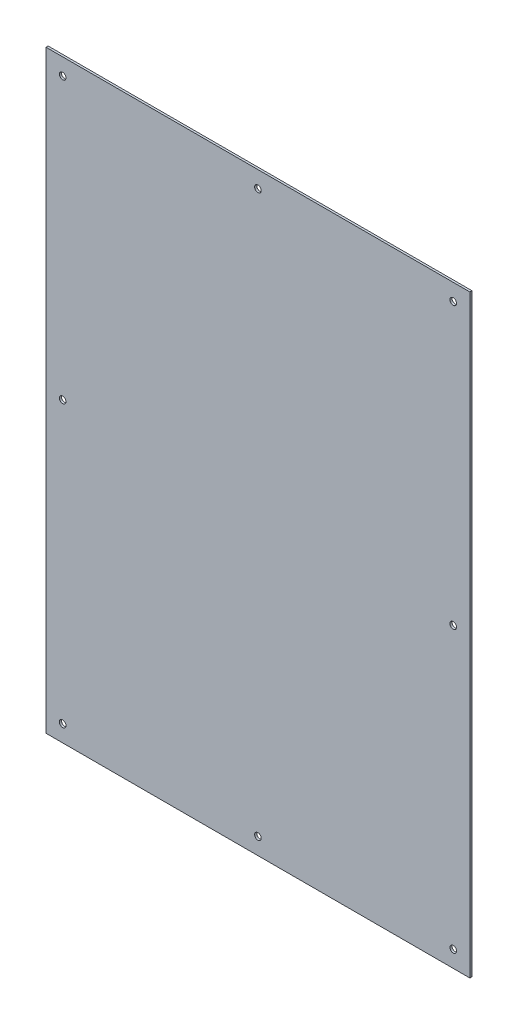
ISO-10303-21;
HEADER;
FILE_DESCRIPTION(('STEP AP214'),'2;1');
FILE_NAME('part.step','',(''),(''),'','','');
FILE_SCHEMA(('AUTOMOTIVE_DESIGN { 1 0 10303 214 1 1 1 1 }'));
ENDSEC;
DATA;
#1=APPLICATION_CONTEXT('core data for automotive mechanical design processes');
#2=APPLICATION_PROTOCOL_DEFINITION('international standard','automotive_design',2000,#1);
#3=PRODUCT_CONTEXT('',#1,'mechanical');
#4=PRODUCT('Part','Part','',(#3));
#5=PRODUCT_RELATED_PRODUCT_CATEGORY('part','',(#4));
#6=PRODUCT_DEFINITION_FORMATION('','',#4);
#7=PRODUCT_DEFINITION_CONTEXT('part definition',#1,'design');
#8=PRODUCT_DEFINITION('design','',#6,#7);
#9=PRODUCT_DEFINITION_SHAPE('','',#8);
#10=(LENGTH_UNIT() NAMED_UNIT(*) SI_UNIT(.MILLI.,.METRE.));
#11=(NAMED_UNIT(*) PLANE_ANGLE_UNIT() SI_UNIT($,.RADIAN.));
#12=(NAMED_UNIT(*) SI_UNIT($,.STERADIAN.) SOLID_ANGLE_UNIT());
#13=UNCERTAINTY_MEASURE_WITH_UNIT(LENGTH_MEASURE(1.E-05),#10,'distance_accuracy_value','');
#14=(GEOMETRIC_REPRESENTATION_CONTEXT(3) GLOBAL_UNCERTAINTY_ASSIGNED_CONTEXT((#13)) GLOBAL_UNIT_ASSIGNED_CONTEXT((#10,
#11,#12)) REPRESENTATION_CONTEXT('',''));
#15=CARTESIAN_POINT('',(0.,0.,0.));
#16=DIRECTION('',(0.,0.,1.));
#17=DIRECTION('',(1.,0.,0.));
#18=AXIS2_PLACEMENT_3D('',#15,#16,#17);
#19=CARTESIAN_POINT('',(-174.625,-454.025,3.2512));
#20=DIRECTION('',(0.,1.,0.));
#21=DIRECTION('',(0.,0.,1.));
#22=AXIS2_PLACEMENT_3D('',#19,#20,#21);
#23=PLANE('',#22);
#24=DIRECTION('',(1.,0.,0.));
#25=VECTOR('',#24,1.);
#26=CARTESIAN_POINT('',(-174.625,-454.025,0.));
#27=LINE('',#26,#25);
#28=CARTESIAN_POINT('',(-174.625,-454.025,0.));
#29=VERTEX_POINT('',#28);
#30=CARTESIAN_POINT('',(473.075,-454.025,0.));
#31=VERTEX_POINT('',#30);
#32=EDGE_CURVE('E95',#29,#31,#27,.T.);
#33=ORIENTED_EDGE('',*,*,#32,.T.);
#34=DIRECTION('',(0.,0.,-1.));
#35=VECTOR('',#34,1.);
#36=CARTESIAN_POINT('',(473.075,-454.025,3.2512));
#37=LINE('',#36,#35);
#38=CARTESIAN_POINT('',(473.075,-454.025,3.2512));
#39=VERTEX_POINT('',#38);
#40=EDGE_CURVE('E11',#39,#31,#37,.T.);
#41=ORIENTED_EDGE('',*,*,#40,.F.);
#42=DIRECTION('',(1.,0.,0.));
#43=VECTOR('',#42,1.);
#44=CARTESIAN_POINT('',(-174.625,-454.025,3.2512));
#45=LINE('',#44,#43);
#46=CARTESIAN_POINT('',(-174.625,-454.025,3.2512));
#47=VERTEX_POINT('',#46);
#48=EDGE_CURVE('E83',#47,#39,#45,.T.);
#49=ORIENTED_EDGE('',*,*,#48,.F.);
#50=DIRECTION('',(0.,0.,-1.));
#51=VECTOR('',#50,1.);
#52=CARTESIAN_POINT('',(-174.625,-454.025,3.2512));
#53=LINE('',#52,#51);
#54=EDGE_CURVE('E91',#47,#29,#53,.T.);
#55=ORIENTED_EDGE('',*,*,#54,.T.);
#56=EDGE_LOOP('',(#33,#41,#49,#55));
#57=FACE_BOUND('',#56,.T.);
#58=ADVANCED_FACE('F32',(#57),#23,.F.);
#59=CARTESIAN_POINT('',(473.075,-454.025,3.2512));
#60=DIRECTION('',(-1.,0.,0.));
#61=DIRECTION('',(0.,-1.,0.));
#62=AXIS2_PLACEMENT_3D('',#59,#60,#61);
#63=PLANE('',#62);
#64=DIRECTION('',(0.,1.,0.));
#65=VECTOR('',#64,1.);
#66=CARTESIAN_POINT('',(473.075,-454.025,0.));
#67=LINE('',#66,#65);
#68=CARTESIAN_POINT('',(473.075,454.025,0.));
#69=VERTEX_POINT('',#68);
#70=EDGE_CURVE('E87',#31,#69,#67,.T.);
#71=ORIENTED_EDGE('',*,*,#70,.T.);
#72=DIRECTION('',(0.,0.,-1.));
#73=VECTOR('',#72,1.);
#74=CARTESIAN_POINT('',(473.075,454.025,3.2512));
#75=LINE('',#74,#73);
#76=CARTESIAN_POINT('',(473.075,454.025,3.2512));
#77=VERTEX_POINT('',#76);
#78=EDGE_CURVE('E40',#77,#69,#75,.T.);
#79=ORIENTED_EDGE('',*,*,#78,.F.);
#80=DIRECTION('',(0.,1.,0.));
#81=VECTOR('',#80,1.);
#82=CARTESIAN_POINT('',(473.075,-454.025,3.2512));
#83=LINE('',#82,#81);
#84=EDGE_CURVE('E78',#39,#77,#83,.T.);
#85=ORIENTED_EDGE('',*,*,#84,.F.);
#86=ORIENTED_EDGE('',*,*,#40,.T.);
#87=EDGE_LOOP('',(#71,#79,#85,#86));
#88=FACE_BOUND('',#87,.T.);
#89=ADVANCED_FACE('F86',(#88),#63,.F.);
#90=CARTESIAN_POINT('',(473.075,454.025,3.2512));
#91=DIRECTION('',(0.,-1.,0.));
#92=DIRECTION('',(1.,0.,0.));
#93=AXIS2_PLACEMENT_3D('',#90,#91,#92);
#94=PLANE('',#93);
#95=DIRECTION('',(-1.,0.,0.));
#96=VECTOR('',#95,1.);
#97=CARTESIAN_POINT('',(473.075,454.025,0.));
#98=LINE('',#97,#96);
#99=CARTESIAN_POINT('',(-174.625,454.025,0.));
#100=VERTEX_POINT('',#99);
#101=EDGE_CURVE('E65',#69,#100,#98,.T.);
#102=ORIENTED_EDGE('',*,*,#101,.T.);
#103=DIRECTION('',(0.,0.,-1.));
#104=VECTOR('',#103,1.);
#105=CARTESIAN_POINT('',(-174.625,454.025,3.2512));
#106=LINE('',#105,#104);
#107=CARTESIAN_POINT('',(-174.625,454.025,3.2512));
#108=VERTEX_POINT('',#107);
#109=EDGE_CURVE('E88',#108,#100,#106,.T.);
#110=ORIENTED_EDGE('',*,*,#109,.F.);
#111=DIRECTION('',(-1.,0.,0.));
#112=VECTOR('',#111,1.);
#113=CARTESIAN_POINT('',(473.075,454.025,3.2512));
#114=LINE('',#113,#112);
#115=EDGE_CURVE('E81',#77,#108,#114,.T.);
#116=ORIENTED_EDGE('',*,*,#115,.F.);
#117=ORIENTED_EDGE('',*,*,#78,.T.);
#118=EDGE_LOOP('',(#102,#110,#116,#117));
#119=FACE_BOUND('',#118,.T.);
#120=ADVANCED_FACE('F89',(#119),#94,.F.);
#121=CARTESIAN_POINT('',(-174.625,454.025,3.2512));
#122=DIRECTION('',(1.,0.,0.));
#123=DIRECTION('',(0.,1.,0.));
#124=AXIS2_PLACEMENT_3D('',#121,#122,#123);
#125=PLANE('',#124);
#126=DIRECTION('',(0.,-1.,0.));
#127=VECTOR('',#126,1.);
#128=CARTESIAN_POINT('',(-174.625,454.025,0.));
#129=LINE('',#128,#127);
#130=EDGE_CURVE('E71',#100,#29,#129,.T.);
#131=ORIENTED_EDGE('',*,*,#130,.T.);
#132=ORIENTED_EDGE('',*,*,#54,.F.);
#133=DIRECTION('',(0.,-1.,0.));
#134=VECTOR('',#133,1.);
#135=CARTESIAN_POINT('',(-174.625,454.025,3.2512));
#136=LINE('',#135,#134);
#137=EDGE_CURVE('E48',#108,#47,#136,.T.);
#138=ORIENTED_EDGE('',*,*,#137,.F.);
#139=ORIENTED_EDGE('',*,*,#109,.T.);
#140=EDGE_LOOP('',(#131,#132,#138,#139));
#141=FACE_BOUND('',#140,.T.);
#142=ADVANCED_FACE('F103',(#141),#125,.F.);
#143=CARTESIAN_POINT('',(-174.625,-454.025,3.2512));
#144=DIRECTION('',(0.,0.,-1.));
#145=DIRECTION('',(-1.,0.,0.));
#146=AXIS2_PLACEMENT_3D('',#143,#144,#145);
#147=PLANE('',#146);
#148=CARTESIAN_POINT('',(-149.225,428.625,3.2512));
#149=DIRECTION('',(0.,0.,1.));
#150=DIRECTION('',(1.,0.,0.));
#151=AXIS2_PLACEMENT_3D('',#148,#149,#150);
#152=CIRCLE('',#151,5.04189999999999);
#153=CARTESIAN_POINT('',(-144.1831,428.625,3.2512));
#154=VERTEX_POINT('',#153);
#155=EDGE_CURVE('E153',#154,#154,#152,.T.);
#156=ORIENTED_EDGE('',*,*,#155,.F.);
#157=EDGE_LOOP('',(#156));
#158=FACE_BOUND('',#157,.T.);
#159=CARTESIAN_POINT('',(-149.225,0.,3.2512));
#160=DIRECTION('',(0.,0.,1.));
#161=DIRECTION('',(1.,0.,0.));
#162=AXIS2_PLACEMENT_3D('',#159,#160,#161);
#163=CIRCLE('',#162,5.04189999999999);
#164=CARTESIAN_POINT('',(-144.1831,0.,3.2512));
#165=VERTEX_POINT('',#164);
#166=EDGE_CURVE('E147',#165,#165,#163,.T.);
#167=ORIENTED_EDGE('',*,*,#166,.F.);
#168=EDGE_LOOP('',(#167));
#169=FACE_BOUND('',#168,.T.);
#170=CARTESIAN_POINT('',(-149.225,-428.625,3.2512));
#171=DIRECTION('',(0.,0.,1.));
#172=DIRECTION('',(1.,0.,0.));
#173=AXIS2_PLACEMENT_3D('',#170,#171,#172);
#174=CIRCLE('',#173,5.04189999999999);
#175=CARTESIAN_POINT('',(-144.1831,-428.625,3.2512));
#176=VERTEX_POINT('',#175);
#177=EDGE_CURVE('E141',#176,#176,#174,.T.);
#178=ORIENTED_EDGE('',*,*,#177,.F.);
#179=EDGE_LOOP('',(#178));
#180=FACE_BOUND('',#179,.T.);
#181=CARTESIAN_POINT('',(149.225,-428.625,3.2512));
#182=DIRECTION('',(0.,0.,1.));
#183=DIRECTION('',(1.,0.,0.));
#184=AXIS2_PLACEMENT_3D('',#181,#182,#183);
#185=CIRCLE('',#184,5.04189999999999);
#186=CARTESIAN_POINT('',(154.2669,-428.625,3.2512));
#187=VERTEX_POINT('',#186);
#188=EDGE_CURVE('E135',#187,#187,#185,.T.);
#189=ORIENTED_EDGE('',*,*,#188,.F.);
#190=EDGE_LOOP('',(#189));
#191=FACE_BOUND('',#190,.T.);
#192=CARTESIAN_POINT('',(447.675,-428.625,3.2512));
#193=DIRECTION('',(0.,0.,1.));
#194=DIRECTION('',(1.,0.,0.));
#195=AXIS2_PLACEMENT_3D('',#192,#193,#194);
#196=CIRCLE('',#195,5.04189999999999);
#197=CARTESIAN_POINT('',(452.7169,-428.625,3.2512));
#198=VERTEX_POINT('',#197);
#199=EDGE_CURVE('E129',#198,#198,#196,.T.);
#200=ORIENTED_EDGE('',*,*,#199,.F.);
#201=EDGE_LOOP('',(#200));
#202=FACE_BOUND('',#201,.T.);
#203=CARTESIAN_POINT('',(447.675,0.,3.2512));
#204=DIRECTION('',(0.,0.,1.));
#205=DIRECTION('',(1.,0.,0.));
#206=AXIS2_PLACEMENT_3D('',#203,#204,#205);
#207=CIRCLE('',#206,5.04189999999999);
#208=CARTESIAN_POINT('',(452.7169,0.,3.2512));
#209=VERTEX_POINT('',#208);
#210=EDGE_CURVE('E123',#209,#209,#207,.T.);
#211=ORIENTED_EDGE('',*,*,#210,.F.);
#212=EDGE_LOOP('',(#211));
#213=FACE_BOUND('',#212,.T.);
#214=CARTESIAN_POINT('',(447.675,428.625,3.2512));
#215=DIRECTION('',(0.,0.,1.));
#216=DIRECTION('',(1.,0.,0.));
#217=AXIS2_PLACEMENT_3D('',#214,#215,#216);
#218=CIRCLE('',#217,5.04189999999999);
#219=CARTESIAN_POINT('',(452.7169,428.625,3.2512));
#220=VERTEX_POINT('',#219);
#221=EDGE_CURVE('E117',#220,#220,#218,.T.);
#222=ORIENTED_EDGE('',*,*,#221,.F.);
#223=EDGE_LOOP('',(#222));
#224=FACE_BOUND('',#223,.T.);
#225=CARTESIAN_POINT('',(149.225,428.625,3.2512));
#226=DIRECTION('',(0.,0.,1.));
#227=DIRECTION('',(1.,0.,0.));
#228=AXIS2_PLACEMENT_3D('',#225,#226,#227);
#229=CIRCLE('',#228,5.04189999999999);
#230=CARTESIAN_POINT('',(154.2669,428.625,3.2512));
#231=VERTEX_POINT('',#230);
#232=EDGE_CURVE('E111',#231,#231,#229,.T.);
#233=ORIENTED_EDGE('',*,*,#232,.F.);
#234=EDGE_LOOP('',(#233));
#235=FACE_BOUND('',#234,.T.);
#236=ORIENTED_EDGE('',*,*,#48,.T.);
#237=ORIENTED_EDGE('',*,*,#84,.T.);
#238=ORIENTED_EDGE('',*,*,#115,.T.);
#239=ORIENTED_EDGE('',*,*,#137,.T.);
#240=EDGE_LOOP('',(#236,#237,#238,#239));
#241=FACE_BOUND('',#240,.T.);
#242=ADVANCED_FACE('F79',(#158,#169,#180,#191,#202,#213,#224,#235,#241),#147,.F.);
#243=CARTESIAN_POINT('',(-174.625,-454.025,0.));
#244=DIRECTION('',(0.,0.,-1.));
#245=DIRECTION('',(-1.,0.,0.));
#246=AXIS2_PLACEMENT_3D('',#243,#244,#245);
#247=PLANE('',#246);
#248=CARTESIAN_POINT('',(-149.225,428.625,0.));
#249=DIRECTION('',(0.,0.,1.));
#250=DIRECTION('',(1.,0.,0.));
#251=AXIS2_PLACEMENT_3D('',#248,#249,#250);
#252=CIRCLE('',#251,5.04189999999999);
#253=CARTESIAN_POINT('',(-144.1831,428.625,0.));
#254=VERTEX_POINT('',#253);
#255=EDGE_CURVE('E150',#254,#254,#252,.T.);
#256=ORIENTED_EDGE('',*,*,#255,.T.);
#257=EDGE_LOOP('',(#256));
#258=FACE_BOUND('',#257,.T.);
#259=CARTESIAN_POINT('',(-149.225,0.,0.));
#260=DIRECTION('',(0.,0.,1.));
#261=DIRECTION('',(1.,0.,0.));
#262=AXIS2_PLACEMENT_3D('',#259,#260,#261);
#263=CIRCLE('',#262,5.04189999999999);
#264=CARTESIAN_POINT('',(-144.1831,0.,0.));
#265=VERTEX_POINT('',#264);
#266=EDGE_CURVE('E144',#265,#265,#263,.T.);
#267=ORIENTED_EDGE('',*,*,#266,.T.);
#268=EDGE_LOOP('',(#267));
#269=FACE_BOUND('',#268,.T.);
#270=CARTESIAN_POINT('',(-149.225,-428.625,0.));
#271=DIRECTION('',(0.,0.,1.));
#272=DIRECTION('',(1.,0.,0.));
#273=AXIS2_PLACEMENT_3D('',#270,#271,#272);
#274=CIRCLE('',#273,5.04189999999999);
#275=CARTESIAN_POINT('',(-144.1831,-428.625,0.));
#276=VERTEX_POINT('',#275);
#277=EDGE_CURVE('E138',#276,#276,#274,.T.);
#278=ORIENTED_EDGE('',*,*,#277,.T.);
#279=EDGE_LOOP('',(#278));
#280=FACE_BOUND('',#279,.T.);
#281=CARTESIAN_POINT('',(149.225,-428.625,0.));
#282=DIRECTION('',(0.,0.,1.));
#283=DIRECTION('',(1.,0.,0.));
#284=AXIS2_PLACEMENT_3D('',#281,#282,#283);
#285=CIRCLE('',#284,5.04189999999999);
#286=CARTESIAN_POINT('',(154.2669,-428.625,0.));
#287=VERTEX_POINT('',#286);
#288=EDGE_CURVE('E132',#287,#287,#285,.T.);
#289=ORIENTED_EDGE('',*,*,#288,.T.);
#290=EDGE_LOOP('',(#289));
#291=FACE_BOUND('',#290,.T.);
#292=CARTESIAN_POINT('',(447.675,-428.625,0.));
#293=DIRECTION('',(0.,0.,1.));
#294=DIRECTION('',(1.,0.,0.));
#295=AXIS2_PLACEMENT_3D('',#292,#293,#294);
#296=CIRCLE('',#295,5.04189999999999);
#297=CARTESIAN_POINT('',(452.7169,-428.625,0.));
#298=VERTEX_POINT('',#297);
#299=EDGE_CURVE('E126',#298,#298,#296,.T.);
#300=ORIENTED_EDGE('',*,*,#299,.T.);
#301=EDGE_LOOP('',(#300));
#302=FACE_BOUND('',#301,.T.);
#303=CARTESIAN_POINT('',(447.675,0.,0.));
#304=DIRECTION('',(0.,0.,1.));
#305=DIRECTION('',(1.,0.,0.));
#306=AXIS2_PLACEMENT_3D('',#303,#304,#305);
#307=CIRCLE('',#306,5.04189999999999);
#308=CARTESIAN_POINT('',(452.7169,0.,0.));
#309=VERTEX_POINT('',#308);
#310=EDGE_CURVE('E120',#309,#309,#307,.T.);
#311=ORIENTED_EDGE('',*,*,#310,.T.);
#312=EDGE_LOOP('',(#311));
#313=FACE_BOUND('',#312,.T.);
#314=CARTESIAN_POINT('',(447.675,428.625,0.));
#315=DIRECTION('',(0.,0.,1.));
#316=DIRECTION('',(1.,0.,0.));
#317=AXIS2_PLACEMENT_3D('',#314,#315,#316);
#318=CIRCLE('',#317,5.04189999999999);
#319=CARTESIAN_POINT('',(452.7169,428.625,0.));
#320=VERTEX_POINT('',#319);
#321=EDGE_CURVE('E114',#320,#320,#318,.T.);
#322=ORIENTED_EDGE('',*,*,#321,.T.);
#323=EDGE_LOOP('',(#322));
#324=FACE_BOUND('',#323,.T.);
#325=CARTESIAN_POINT('',(149.225,428.625,0.));
#326=DIRECTION('',(0.,0.,1.));
#327=DIRECTION('',(1.,0.,0.));
#328=AXIS2_PLACEMENT_3D('',#325,#326,#327);
#329=CIRCLE('',#328,5.04189999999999);
#330=CARTESIAN_POINT('',(154.2669,428.625,0.));
#331=VERTEX_POINT('',#330);
#332=EDGE_CURVE('E98',#331,#331,#329,.T.);
#333=ORIENTED_EDGE('',*,*,#332,.T.);
#334=EDGE_LOOP('',(#333));
#335=FACE_BOUND('',#334,.T.);
#336=ORIENTED_EDGE('',*,*,#32,.F.);
#337=ORIENTED_EDGE('',*,*,#130,.F.);
#338=ORIENTED_EDGE('',*,*,#101,.F.);
#339=ORIENTED_EDGE('',*,*,#70,.F.);
#340=EDGE_LOOP('',(#336,#337,#338,#339));
#341=FACE_BOUND('',#340,.T.);
#342=ADVANCED_FACE('F106',(#258,#269,#280,#291,#302,#313,#324,#335,#341),#247,.T.);
#343=CARTESIAN_POINT('',(149.225,428.625,3.2512));
#344=DIRECTION('',(0.,0.,1.));
#345=DIRECTION('',(1.,0.,0.));
#346=AXIS2_PLACEMENT_3D('',#343,#344,#345);
#347=CYLINDRICAL_SURFACE('',#346,5.04189999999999);
#348=ORIENTED_EDGE('',*,*,#332,.F.);
#349=EDGE_LOOP('',(#348));
#350=FACE_BOUND('',#349,.T.);
#351=ORIENTED_EDGE('',*,*,#232,.T.);
#352=EDGE_LOOP('',(#351));
#353=FACE_BOUND('',#352,.T.);
#354=ADVANCED_FACE('F176',(#350,#353),#347,.F.);
#355=CARTESIAN_POINT('',(447.675,428.625,3.2512));
#356=DIRECTION('',(0.,0.,1.));
#357=DIRECTION('',(1.,0.,0.));
#358=AXIS2_PLACEMENT_3D('',#355,#356,#357);
#359=CYLINDRICAL_SURFACE('',#358,5.04189999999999);
#360=ORIENTED_EDGE('',*,*,#321,.F.);
#361=EDGE_LOOP('',(#360));
#362=FACE_BOUND('',#361,.T.);
#363=ORIENTED_EDGE('',*,*,#221,.T.);
#364=EDGE_LOOP('',(#363));
#365=FACE_BOUND('',#364,.T.);
#366=ADVANCED_FACE('F178',(#362,#365),#359,.F.);
#367=CARTESIAN_POINT('',(447.675,0.,3.2512));
#368=DIRECTION('',(0.,0.,1.));
#369=DIRECTION('',(1.,0.,0.));
#370=AXIS2_PLACEMENT_3D('',#367,#368,#369);
#371=CYLINDRICAL_SURFACE('',#370,5.04189999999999);
#372=ORIENTED_EDGE('',*,*,#310,.F.);
#373=EDGE_LOOP('',(#372));
#374=FACE_BOUND('',#373,.T.);
#375=ORIENTED_EDGE('',*,*,#210,.T.);
#376=EDGE_LOOP('',(#375));
#377=FACE_BOUND('',#376,.T.);
#378=ADVANCED_FACE('F185',(#374,#377),#371,.F.);
#379=CARTESIAN_POINT('',(447.675,-428.625,3.2512));
#380=DIRECTION('',(0.,0.,1.));
#381=DIRECTION('',(1.,0.,0.));
#382=AXIS2_PLACEMENT_3D('',#379,#380,#381);
#383=CYLINDRICAL_SURFACE('',#382,5.04189999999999);
#384=ORIENTED_EDGE('',*,*,#299,.F.);
#385=EDGE_LOOP('',(#384));
#386=FACE_BOUND('',#385,.T.);
#387=ORIENTED_EDGE('',*,*,#199,.T.);
#388=EDGE_LOOP('',(#387));
#389=FACE_BOUND('',#388,.T.);
#390=ADVANCED_FACE('F232',(#386,#389),#383,.F.);
#391=CARTESIAN_POINT('',(149.225,-428.625,3.2512));
#392=DIRECTION('',(0.,0.,1.));
#393=DIRECTION('',(1.,0.,0.));
#394=AXIS2_PLACEMENT_3D('',#391,#392,#393);
#395=CYLINDRICAL_SURFACE('',#394,5.04189999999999);
#396=ORIENTED_EDGE('',*,*,#288,.F.);
#397=EDGE_LOOP('',(#396));
#398=FACE_BOUND('',#397,.T.);
#399=ORIENTED_EDGE('',*,*,#188,.T.);
#400=EDGE_LOOP('',(#399));
#401=FACE_BOUND('',#400,.T.);
#402=ADVANCED_FACE('F242',(#398,#401),#395,.F.);
#403=CARTESIAN_POINT('',(-149.225,-428.625,3.2512));
#404=DIRECTION('',(0.,0.,1.));
#405=DIRECTION('',(1.,0.,0.));
#406=AXIS2_PLACEMENT_3D('',#403,#404,#405);
#407=CYLINDRICAL_SURFACE('',#406,5.04189999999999);
#408=ORIENTED_EDGE('',*,*,#277,.F.);
#409=EDGE_LOOP('',(#408));
#410=FACE_BOUND('',#409,.T.);
#411=ORIENTED_EDGE('',*,*,#177,.T.);
#412=EDGE_LOOP('',(#411));
#413=FACE_BOUND('',#412,.T.);
#414=ADVANCED_FACE('F252',(#410,#413),#407,.F.);
#415=CARTESIAN_POINT('',(-149.225,0.,3.2512));
#416=DIRECTION('',(0.,0.,1.));
#417=DIRECTION('',(1.,0.,0.));
#418=AXIS2_PLACEMENT_3D('',#415,#416,#417);
#419=CYLINDRICAL_SURFACE('',#418,5.04189999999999);
#420=ORIENTED_EDGE('',*,*,#266,.F.);
#421=EDGE_LOOP('',(#420));
#422=FACE_BOUND('',#421,.T.);
#423=ORIENTED_EDGE('',*,*,#166,.T.);
#424=EDGE_LOOP('',(#423));
#425=FACE_BOUND('',#424,.T.);
#426=ADVANCED_FACE('F262',(#422,#425),#419,.F.);
#427=CARTESIAN_POINT('',(-149.225,428.625,3.2512));
#428=DIRECTION('',(0.,0.,1.));
#429=DIRECTION('',(1.,0.,0.));
#430=AXIS2_PLACEMENT_3D('',#427,#428,#429);
#431=CYLINDRICAL_SURFACE('',#430,5.04189999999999);
#432=ORIENTED_EDGE('',*,*,#255,.F.);
#433=EDGE_LOOP('',(#432));
#434=FACE_BOUND('',#433,.T.);
#435=ORIENTED_EDGE('',*,*,#155,.T.);
#436=EDGE_LOOP('',(#435));
#437=FACE_BOUND('',#436,.T.);
#438=ADVANCED_FACE('F157',(#434,#437),#431,.F.);
#439=CLOSED_SHELL('',(#58,#89,#120,#142,#242,#342,#354,#366,#378,#390,#402,#414,#426,#438));
#440=MANIFOLD_SOLID_BREP('B2',#439);
#441=ADVANCED_BREP_SHAPE_REPRESENTATION('',(#18,#440),#14);
#442=SHAPE_DEFINITION_REPRESENTATION(#9,#441);
ENDSEC;
END-ISO-10303-21;
